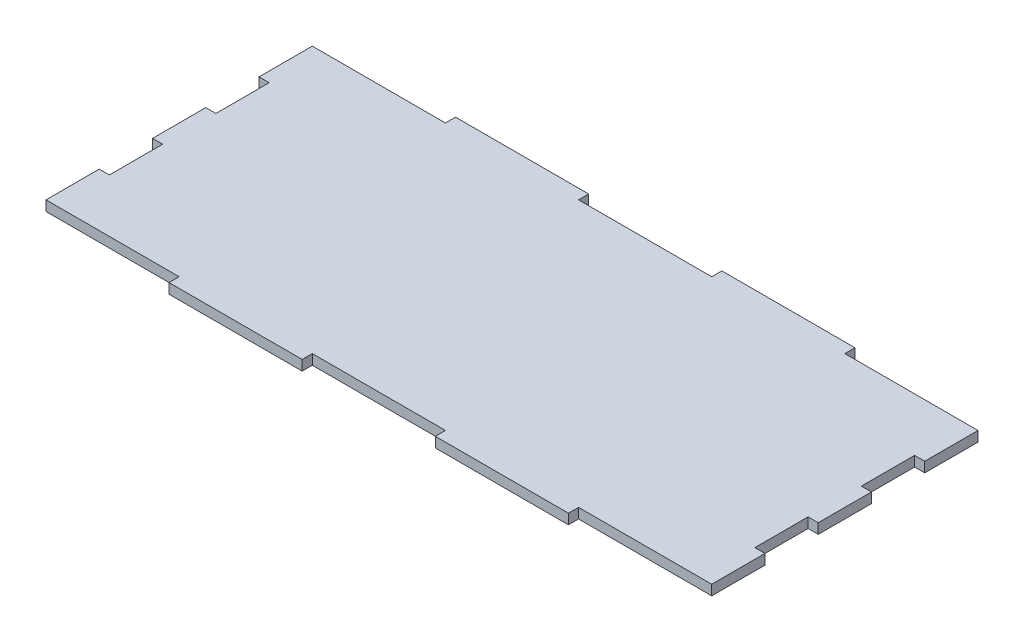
from build123d import *

# Parameters (mm, degrees)
BOSS_EXTRUDE1_DEPTH = 2.28


with BuildPart() as part:
    # Sketch3 → Boss-Extrude1 (new body)
    with BuildSketch(Plane(origin=(0, 0, 0), x_dir=(1, 0, 0), z_dir=(0, 1, 0))):
        Polygon((-45, -30), (-45, -32.28), (-15, -32.28), (-15, -30), (15, -30), (15, -32.28), (45, -32.28), (45, -30), (74.558406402, -30), (75, -30), (75, -18), (72.72, -18), (72.72, -6), (75, -6), (75, 6), (72.72, 6), (72.72, 18), (75, 18), (75, 30), (45, 30), (45, 32.28), (15, 32.28), (15, 30), (-15, 30), (-15, 32.28), (-45, 32.28), (-45, 30), (-75, 30), (-75, 18), (-72.72, 18), (-72.72, 6), (-75, 6), (-75, -6), (-72.72, -6), (-72.72, -18), (-75, -18), (-75, -30), align=None)
    extrude(amount=BOSS_EXTRUDE1_DEPTH)


solid = part.part
